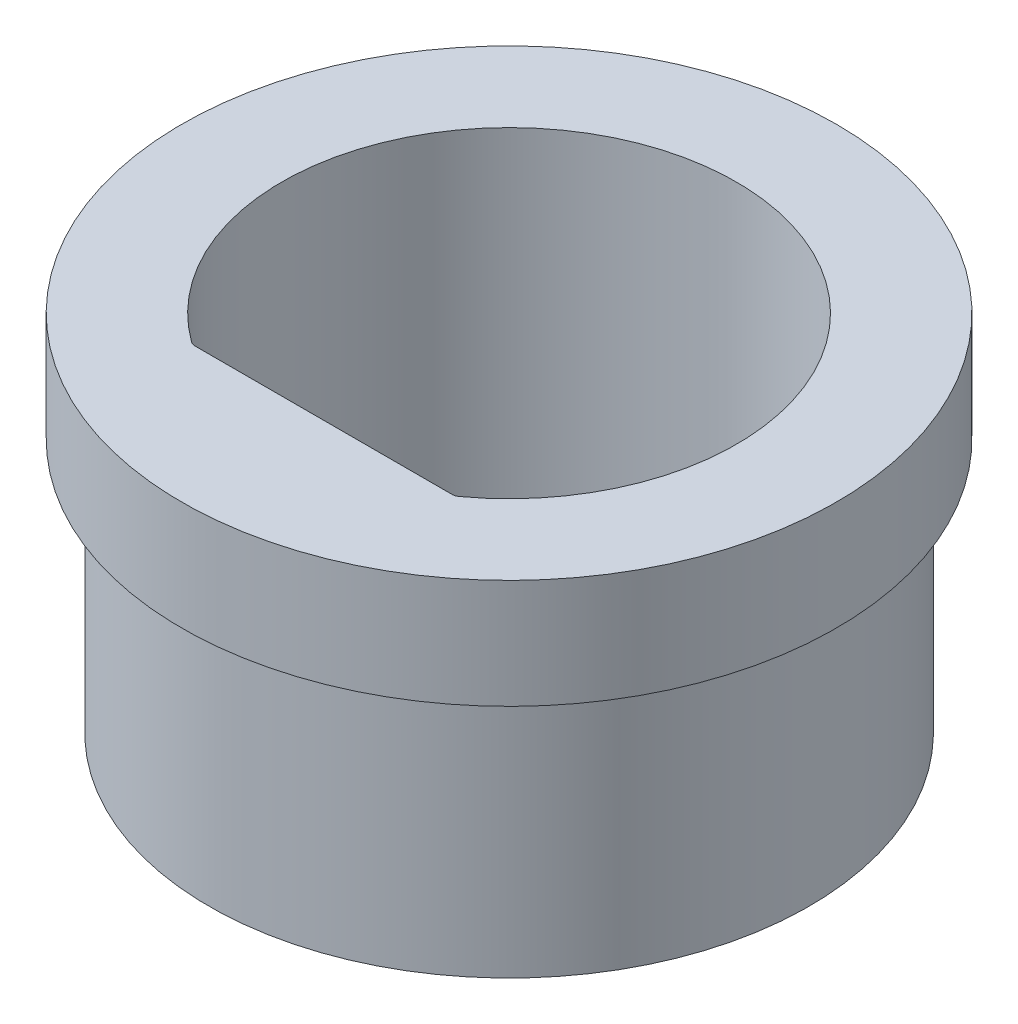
ISO-10303-21;
HEADER;
FILE_DESCRIPTION(('STEP AP214'),'2;1');
FILE_NAME('part.step','',(''),(''),'','','');
FILE_SCHEMA(('AUTOMOTIVE_DESIGN { 1 0 10303 214 1 1 1 1 }'));
ENDSEC;
DATA;
#1=APPLICATION_CONTEXT('core data for automotive mechanical design processes');
#2=APPLICATION_PROTOCOL_DEFINITION('international standard','automotive_design',2000,#1);
#3=PRODUCT_CONTEXT('',#1,'mechanical');
#4=PRODUCT('Part','Part','',(#3));
#5=PRODUCT_RELATED_PRODUCT_CATEGORY('part','',(#4));
#6=PRODUCT_DEFINITION_FORMATION('','',#4);
#7=PRODUCT_DEFINITION_CONTEXT('part definition',#1,'design');
#8=PRODUCT_DEFINITION('design','',#6,#7);
#9=PRODUCT_DEFINITION_SHAPE('','',#8);
#10=(LENGTH_UNIT() NAMED_UNIT(*) SI_UNIT(.MILLI.,.METRE.));
#11=(NAMED_UNIT(*) PLANE_ANGLE_UNIT() SI_UNIT($,.RADIAN.));
#12=(NAMED_UNIT(*) SI_UNIT($,.STERADIAN.) SOLID_ANGLE_UNIT());
#13=UNCERTAINTY_MEASURE_WITH_UNIT(LENGTH_MEASURE(1.E-05),#10,'distance_accuracy_value','');
#14=(GEOMETRIC_REPRESENTATION_CONTEXT(3) GLOBAL_UNCERTAINTY_ASSIGNED_CONTEXT((#13)) GLOBAL_UNIT_ASSIGNED_CONTEXT((#10,
#11,#12)) REPRESENTATION_CONTEXT('',''));
#15=CARTESIAN_POINT('',(0.,0.,0.));
#16=DIRECTION('',(0.,0.,1.));
#17=DIRECTION('',(1.,0.,0.));
#18=AXIS2_PLACEMENT_3D('',#15,#16,#17);
#19=CARTESIAN_POINT('',(18.,20.,0.));
#20=DIRECTION('',(0.,1.,0.));
#21=DIRECTION('',(0.,0.,1.));
#22=AXIS2_PLACEMENT_3D('',#19,#20,#21);
#23=PLANE('',#22);
#24=CARTESIAN_POINT('',(0.,20.,0.));
#25=DIRECTION('',(0.,1.,0.));
#26=DIRECTION('',(0.,0.,1.));
#27=AXIS2_PLACEMENT_3D('',#24,#25,#26);
#28=CIRCLE('',#27,12.5);
#29=CARTESIAN_POINT('',(7.3590635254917,20.,10.1041666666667));
#30=VERTEX_POINT('',#29);
#31=CARTESIAN_POINT('',(-7.3590635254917,20.,10.1041666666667));
#32=VERTEX_POINT('',#31);
#33=EDGE_CURVE('E85',#30,#32,#28,.T.);
#34=ORIENTED_EDGE('',*,*,#33,.F.);
#35=CARTESIAN_POINT('',(7.06470098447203,20.,9.7));
#36=DIRECTION('',(0.,1.,0.));
#37=DIRECTION('',(0.,0.,1.));
#38=AXIS2_PLACEMENT_3D('',#35,#36,#37);
#39=CIRCLE('',#38,0.5);
#40=CARTESIAN_POINT('',(7.06470098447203,20.,10.2));
#41=VERTEX_POINT('',#40);
#42=EDGE_CURVE('E71',#30,#41,#39,.F.);
#43=ORIENTED_EDGE('',*,*,#42,.T.);
#44=DIRECTION('',(1.,0.,0.));
#45=VECTOR('',#44,1.);
#46=CARTESIAN_POINT('',(7.22564875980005,20.,10.2));
#47=LINE('',#46,#45);
#48=CARTESIAN_POINT('',(-7.06470098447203,20.,10.2));
#49=VERTEX_POINT('',#48);
#50=EDGE_CURVE('E92',#49,#41,#47,.T.);
#51=ORIENTED_EDGE('',*,*,#50,.F.);
#52=CARTESIAN_POINT('',(-7.06470098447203,20.,9.7));
#53=DIRECTION('',(0.,1.,0.));
#54=DIRECTION('',(0.,0.,1.));
#55=AXIS2_PLACEMENT_3D('',#52,#53,#54);
#56=CIRCLE('',#55,0.5);
#57=EDGE_CURVE('E39',#49,#32,#56,.F.);
#58=ORIENTED_EDGE('',*,*,#57,.T.);
#59=EDGE_LOOP('',(#34,#43,#51,#58));
#60=FACE_BOUND('',#59,.T.);
#61=CARTESIAN_POINT('',(0.,20.,0.));
#62=DIRECTION('',(0.,-1.,0.));
#63=DIRECTION('',(0.,0.,-1.));
#64=AXIS2_PLACEMENT_3D('',#61,#62,#63);
#65=CIRCLE('',#64,18.);
#66=CARTESIAN_POINT('',(0.,20.,-18.));
#67=VERTEX_POINT('',#66);
#68=EDGE_CURVE('E99',#67,#67,#65,.T.);
#69=ORIENTED_EDGE('',*,*,#68,.F.);
#70=EDGE_LOOP('',(#69));
#71=FACE_BOUND('',#70,.T.);
#72=ADVANCED_FACE('F32',(#60,#71),#23,.T.);
#73=CARTESIAN_POINT('',(0.,0.,0.));
#74=DIRECTION('',(0.,-1.,0.));
#75=DIRECTION('',(0.,0.,-1.));
#76=AXIS2_PLACEMENT_3D('',#73,#74,#75);
#77=PLANE('',#76);
#78=DIRECTION('',(1.,0.,0.));
#79=VECTOR('',#78,1.);
#80=CARTESIAN_POINT('',(7.22564875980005,0.,10.2));
#81=LINE('',#80,#79);
#82=CARTESIAN_POINT('',(-7.06470098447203,0.,10.2));
#83=VERTEX_POINT('',#82);
#84=CARTESIAN_POINT('',(7.06470098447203,0.,10.2));
#85=VERTEX_POINT('',#84);
#86=EDGE_CURVE('E97',#83,#85,#81,.T.);
#87=ORIENTED_EDGE('',*,*,#86,.T.);
#88=CARTESIAN_POINT('',(7.06470098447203,0.,9.7));
#89=DIRECTION('',(0.,-1.,0.));
#90=DIRECTION('',(0.,0.,-1.));
#91=AXIS2_PLACEMENT_3D('',#88,#89,#90);
#92=CIRCLE('',#91,0.5);
#93=CARTESIAN_POINT('',(7.3590635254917,0.,10.1041666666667));
#94=VERTEX_POINT('',#93);
#95=EDGE_CURVE('E79',#85,#94,#92,.F.);
#96=ORIENTED_EDGE('',*,*,#95,.T.);
#97=CARTESIAN_POINT('',(0.,0.,0.));
#98=DIRECTION('',(0.,1.,0.));
#99=DIRECTION('',(0.,0.,1.));
#100=AXIS2_PLACEMENT_3D('',#97,#98,#99);
#101=CIRCLE('',#100,12.5);
#102=CARTESIAN_POINT('',(-7.3590635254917,0.,10.1041666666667));
#103=VERTEX_POINT('',#102);
#104=EDGE_CURVE('E87',#94,#103,#101,.T.);
#105=ORIENTED_EDGE('',*,*,#104,.T.);
#106=CARTESIAN_POINT('',(-7.06470098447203,0.,9.7));
#107=DIRECTION('',(0.,-1.,0.));
#108=DIRECTION('',(0.,0.,-1.));
#109=AXIS2_PLACEMENT_3D('',#106,#107,#108);
#110=CIRCLE('',#109,0.5);
#111=EDGE_CURVE('E11',#103,#83,#110,.F.);
#112=ORIENTED_EDGE('',*,*,#111,.T.);
#113=EDGE_LOOP('',(#87,#96,#105,#112));
#114=FACE_BOUND('',#113,.T.);
#115=CARTESIAN_POINT('',(0.,0.,0.));
#116=DIRECTION('',(0.,-1.,0.));
#117=DIRECTION('',(0.,0.,-1.));
#118=AXIS2_PLACEMENT_3D('',#115,#116,#117);
#119=CIRCLE('',#118,16.5);
#120=CARTESIAN_POINT('',(0.,0.,-16.5));
#121=VERTEX_POINT('',#120);
#122=EDGE_CURVE('E108',#121,#121,#119,.T.);
#123=ORIENTED_EDGE('',*,*,#122,.T.);
#124=EDGE_LOOP('',(#123));
#125=FACE_BOUND('',#124,.T.);
#126=ADVANCED_FACE('F116',(#114,#125),#77,.T.);
#127=CARTESIAN_POINT('',(0.,0.,0.));
#128=DIRECTION('',(0.,-1.,0.));
#129=DIRECTION('',(0.,0.,-1.));
#130=AXIS2_PLACEMENT_3D('',#127,#128,#129);
#131=CYLINDRICAL_SURFACE('',#130,16.5);
#132=CARTESIAN_POINT('',(0.,14.,0.));
#133=DIRECTION('',(0.,-1.,0.));
#134=DIRECTION('',(0.,0.,-1.));
#135=AXIS2_PLACEMENT_3D('',#132,#133,#134);
#136=CIRCLE('',#135,16.5);
#137=CARTESIAN_POINT('',(0.,14.,-16.5));
#138=VERTEX_POINT('',#137);
#139=EDGE_CURVE('E105',#138,#138,#136,.T.);
#140=ORIENTED_EDGE('',*,*,#139,.T.);
#141=EDGE_LOOP('',(#140));
#142=FACE_BOUND('',#141,.T.);
#143=ORIENTED_EDGE('',*,*,#122,.F.);
#144=EDGE_LOOP('',(#143));
#145=FACE_BOUND('',#144,.T.);
#146=ADVANCED_FACE('F132',(#142,#145),#131,.T.);
#147=CARTESIAN_POINT('',(16.5,14.,0.));
#148=DIRECTION('',(0.,-1.,0.));
#149=DIRECTION('',(0.,0.,-1.));
#150=AXIS2_PLACEMENT_3D('',#147,#148,#149);
#151=PLANE('',#150);
#152=CARTESIAN_POINT('',(0.,14.,0.));
#153=DIRECTION('',(0.,-1.,0.));
#154=DIRECTION('',(0.,0.,-1.));
#155=AXIS2_PLACEMENT_3D('',#152,#153,#154);
#156=CIRCLE('',#155,18.);
#157=CARTESIAN_POINT('',(0.,14.,-18.));
#158=VERTEX_POINT('',#157);
#159=EDGE_CURVE('E102',#158,#158,#156,.T.);
#160=ORIENTED_EDGE('',*,*,#159,.T.);
#161=EDGE_LOOP('',(#160));
#162=FACE_BOUND('',#161,.T.);
#163=ORIENTED_EDGE('',*,*,#139,.F.);
#164=EDGE_LOOP('',(#163));
#165=FACE_BOUND('',#164,.T.);
#166=ADVANCED_FACE('F136',(#162,#165),#151,.T.);
#167=CARTESIAN_POINT('',(0.,0.,0.));
#168=DIRECTION('',(0.,-1.,0.));
#169=DIRECTION('',(0.,0.,-1.));
#170=AXIS2_PLACEMENT_3D('',#167,#168,#169);
#171=CYLINDRICAL_SURFACE('',#170,18.);
#172=ORIENTED_EDGE('',*,*,#68,.T.);
#173=EDGE_LOOP('',(#172));
#174=FACE_BOUND('',#173,.T.);
#175=ORIENTED_EDGE('',*,*,#159,.F.);
#176=EDGE_LOOP('',(#175));
#177=FACE_BOUND('',#176,.T.);
#178=ADVANCED_FACE('F142',(#174,#177),#171,.T.);
#179=CARTESIAN_POINT('',(0.,0.,0.));
#180=DIRECTION('',(0.,1.,0.));
#181=DIRECTION('',(0.,0.,1.));
#182=AXIS2_PLACEMENT_3D('',#179,#180,#181);
#183=CYLINDRICAL_SURFACE('',#182,12.5);
#184=ORIENTED_EDGE('',*,*,#104,.F.);
#185=DIRECTION('',(0.,1.,0.));
#186=VECTOR('',#185,1.);
#187=CARTESIAN_POINT('',(7.3590635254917,0.,10.1041666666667));
#188=LINE('',#187,#186);
#189=EDGE_CURVE('E75',#94,#30,#188,.T.);
#190=ORIENTED_EDGE('',*,*,#189,.T.);
#191=ORIENTED_EDGE('',*,*,#33,.T.);
#192=DIRECTION('',(0.,1.,0.));
#193=VECTOR('',#192,1.);
#194=CARTESIAN_POINT('',(-7.3590635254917,0.,10.1041666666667));
#195=LINE('',#194,#193);
#196=EDGE_CURVE('E89',#32,#103,#195,.F.);
#197=ORIENTED_EDGE('',*,*,#196,.T.);
#198=EDGE_LOOP('',(#184,#190,#191,#197));
#199=FACE_BOUND('',#198,.T.);
#200=ADVANCED_FACE('F84',(#199),#183,.F.);
#201=CARTESIAN_POINT('',(7.22564875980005,0.,10.2));
#202=DIRECTION('',(0.,0.,1.));
#203=DIRECTION('',(1.,0.,0.));
#204=AXIS2_PLACEMENT_3D('',#201,#202,#203);
#205=PLANE('',#204);
#206=ORIENTED_EDGE('',*,*,#50,.T.);
#207=DIRECTION('',(0.,-1.,0.));
#208=VECTOR('',#207,1.);
#209=CARTESIAN_POINT('',(7.06470098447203,0.,10.2));
#210=LINE('',#209,#208);
#211=EDGE_CURVE('E46',#41,#85,#210,.T.);
#212=ORIENTED_EDGE('',*,*,#211,.T.);
#213=ORIENTED_EDGE('',*,*,#86,.F.);
#214=DIRECTION('',(0.,-1.,0.));
#215=VECTOR('',#214,1.);
#216=CARTESIAN_POINT('',(-7.06470098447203,20.,10.2));
#217=LINE('',#216,#215);
#218=EDGE_CURVE('E88',#83,#49,#217,.F.);
#219=ORIENTED_EDGE('',*,*,#218,.T.);
#220=EDGE_LOOP('',(#206,#212,#213,#219));
#221=FACE_BOUND('',#220,.T.);
#222=ADVANCED_FACE('F119',(#221),#205,.F.);
#223=CARTESIAN_POINT('',(7.06470098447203,0.,9.7));
#224=DIRECTION('',(0.,1.,0.));
#225=DIRECTION('',(0.,0.,1.));
#226=AXIS2_PLACEMENT_3D('',#223,#224,#225);
#227=CYLINDRICAL_SURFACE('',#226,0.5);
#228=ORIENTED_EDGE('',*,*,#95,.F.);
#229=ORIENTED_EDGE('',*,*,#211,.F.);
#230=ORIENTED_EDGE('',*,*,#42,.F.);
#231=ORIENTED_EDGE('',*,*,#189,.F.);
#232=EDGE_LOOP('',(#228,#229,#230,#231));
#233=FACE_BOUND('',#232,.T.);
#234=ADVANCED_FACE('F74',(#233),#227,.F.);
#235=CARTESIAN_POINT('',(-7.06470098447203,0.,9.7));
#236=DIRECTION('',(0.,1.,0.));
#237=DIRECTION('',(0.,0.,1.));
#238=AXIS2_PLACEMENT_3D('',#235,#236,#237);
#239=CYLINDRICAL_SURFACE('',#238,0.5);
#240=ORIENTED_EDGE('',*,*,#111,.F.);
#241=ORIENTED_EDGE('',*,*,#196,.F.);
#242=ORIENTED_EDGE('',*,*,#57,.F.);
#243=ORIENTED_EDGE('',*,*,#218,.F.);
#244=EDGE_LOOP('',(#240,#241,#242,#243));
#245=FACE_BOUND('',#244,.T.);
#246=ADVANCED_FACE('F121',(#245),#239,.F.);
#247=CLOSED_SHELL('',(#72,#126,#146,#166,#178,#200,#222,#234,#246));
#248=MANIFOLD_SOLID_BREP('B2',#247);
#249=ADVANCED_BREP_SHAPE_REPRESENTATION('',(#18,#248),#14);
#250=SHAPE_DEFINITION_REPRESENTATION(#9,#249);
ENDSEC;
END-ISO-10303-21;
